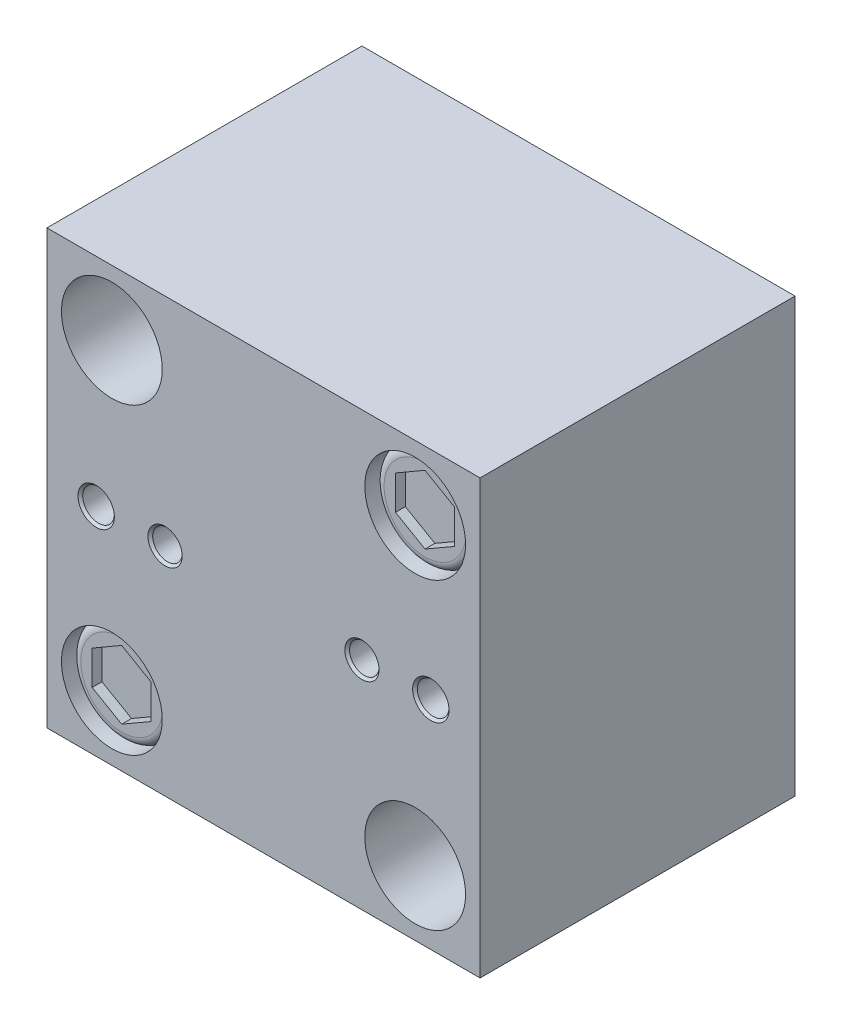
ISO-10303-21;
HEADER;
FILE_DESCRIPTION(('STEP AP214'),'2;1');
FILE_NAME('part.step','',(''),(''),'','','');
FILE_SCHEMA(('AUTOMOTIVE_DESIGN { 1 0 10303 214 1 1 1 1 }'));
ENDSEC;
DATA;
#1=APPLICATION_CONTEXT('core data for automotive mechanical design processes');
#2=APPLICATION_PROTOCOL_DEFINITION('international standard','automotive_design',2000,#1);
#3=PRODUCT_CONTEXT('',#1,'mechanical');
#4=PRODUCT('Part','Part','',(#3));
#5=PRODUCT_RELATED_PRODUCT_CATEGORY('part','',(#4));
#6=PRODUCT_DEFINITION_FORMATION('','',#4);
#7=PRODUCT_DEFINITION_CONTEXT('part definition',#1,'design');
#8=PRODUCT_DEFINITION('design','',#6,#7);
#9=PRODUCT_DEFINITION_SHAPE('','',#8);
#10=(LENGTH_UNIT() NAMED_UNIT(*) SI_UNIT(.MILLI.,.METRE.));
#11=(NAMED_UNIT(*) PLANE_ANGLE_UNIT() SI_UNIT($,.RADIAN.));
#12=(NAMED_UNIT(*) SI_UNIT($,.STERADIAN.) SOLID_ANGLE_UNIT());
#13=UNCERTAINTY_MEASURE_WITH_UNIT(LENGTH_MEASURE(1.E-05),#10,'distance_accuracy_value','');
#14=(GEOMETRIC_REPRESENTATION_CONTEXT(3) GLOBAL_UNCERTAINTY_ASSIGNED_CONTEXT((#13)) GLOBAL_UNIT_ASSIGNED_CONTEXT((#10,
#11,#12)) REPRESENTATION_CONTEXT('',''));
#15=CARTESIAN_POINT('',(0.,0.,0.));
#16=DIRECTION('',(0.,0.,1.));
#17=DIRECTION('',(1.,0.,0.));
#18=AXIS2_PLACEMENT_3D('',#15,#16,#17);
#19=CARTESIAN_POINT('',(-34.925,-34.925,49.2125));
#20=DIRECTION('',(0.,0.,1.));
#21=DIRECTION('',(1.,0.,0.));
#22=AXIS2_PLACEMENT_3D('',#19,#20,#21);
#23=PLANE('',#22);
#24=DIRECTION('',(-0.866025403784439,0.5,0.));
#25=VECTOR('',#24,1.);
#26=CARTESIAN_POINT('',(-19.6977,-21.7105693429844,49.2125));
#27=LINE('',#26,#25);
#28=CARTESIAN_POINT('',(-19.6977,-21.7105693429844,49.2125));
#29=VERTEX_POINT('',#28);
#30=CARTESIAN_POINT('',(-24.4602,-18.9609386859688,49.2125));
#31=VERTEX_POINT('',#30);
#32=EDGE_CURVE('E63',#29,#31,#27,.T.);
#33=ORIENTED_EDGE('',*,*,#32,.F.);
#34=DIRECTION('',(0.,1.,0.));
#35=VECTOR('',#34,1.);
#36=CARTESIAN_POINT('',(-19.6977,-27.2098306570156,49.2125));
#37=LINE('',#36,#35);
#38=CARTESIAN_POINT('',(-19.6977,-27.2098306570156,49.2125));
#39=VERTEX_POINT('',#38);
#40=EDGE_CURVE('E146',#39,#29,#37,.T.);
#41=ORIENTED_EDGE('',*,*,#40,.F.);
#42=DIRECTION('',(0.866025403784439,0.5,0.));
#43=VECTOR('',#42,1.);
#44=CARTESIAN_POINT('',(-24.4602,-29.9594613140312,49.2125));
#45=LINE('',#44,#43);
#46=CARTESIAN_POINT('',(-24.4602,-29.9594613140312,49.2125));
#47=VERTEX_POINT('',#46);
#48=EDGE_CURVE('E144',#47,#39,#45,.T.);
#49=ORIENTED_EDGE('',*,*,#48,.F.);
#50=DIRECTION('',(0.866025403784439,-0.499999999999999,0.));
#51=VECTOR('',#50,1.);
#52=CARTESIAN_POINT('',(-29.2227,-27.2098306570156,49.2125));
#53=LINE('',#52,#51);
#54=CARTESIAN_POINT('',(-29.2227,-27.2098306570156,49.2125));
#55=VERTEX_POINT('',#54);
#56=EDGE_CURVE('E111',#55,#47,#53,.T.);
#57=ORIENTED_EDGE('',*,*,#56,.F.);
#58=DIRECTION('',(0.,-1.,0.));
#59=VECTOR('',#58,1.);
#60=CARTESIAN_POINT('',(-29.2227,-21.7105693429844,49.2125));
#61=LINE('',#60,#59);
#62=CARTESIAN_POINT('',(-29.2227,-21.7105693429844,49.2125));
#63=VERTEX_POINT('',#62);
#64=EDGE_CURVE('E140',#63,#55,#61,.T.);
#65=ORIENTED_EDGE('',*,*,#64,.F.);
#66=DIRECTION('',(-0.866025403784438,-0.5,0.));
#67=VECTOR('',#66,1.);
#68=CARTESIAN_POINT('',(-24.4602,-18.9609386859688,49.2125));
#69=LINE('',#68,#67);
#70=EDGE_CURVE('E137',#31,#63,#69,.T.);
#71=ORIENTED_EDGE('',*,*,#70,.F.);
#72=EDGE_LOOP('',(#33,#41,#49,#57,#65,#71));
#73=FACE_BOUND('',#72,.T.);
#74=CARTESIAN_POINT('',(-24.4602,-24.4602,49.2125));
#75=DIRECTION('',(0.,0.,1.));
#76=DIRECTION('',(1.,0.,0.));
#77=AXIS2_PLACEMENT_3D('',#74,#75,#76);
#78=CIRCLE('',#77,6.60399999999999);
#79=CARTESIAN_POINT('',(-17.8562,-24.4602,49.2125));
#80=VERTEX_POINT('',#79);
#81=EDGE_CURVE('E12',#80,#80,#78,.T.);
#82=ORIENTED_EDGE('',*,*,#81,.T.);
#83=EDGE_LOOP('',(#82));
#84=FACE_BOUND('',#83,.T.);
#85=ADVANCED_FACE('F48',(#73,#84),#23,.T.);
#86=CARTESIAN_POINT('',(-24.4602,-24.4602,0.));
#87=DIRECTION('',(0.,0.,-1.));
#88=DIRECTION('',(-1.,0.,0.));
#89=AXIS2_PLACEMENT_3D('',#86,#87,#88);
#90=PLANE('',#89);
#91=CARTESIAN_POINT('',(-24.4602,-24.4602,0.));
#92=DIRECTION('',(0.,0.,-1.));
#93=DIRECTION('',(-1.,0.,0.));
#94=AXIS2_PLACEMENT_3D('',#91,#92,#93);
#95=CIRCLE('',#94,8.12799999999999);
#96=CARTESIAN_POINT('',(-32.5882,-24.4602,0.));
#97=VERTEX_POINT('',#96);
#98=EDGE_CURVE('E150',#97,#97,#95,.T.);
#99=ORIENTED_EDGE('',*,*,#98,.T.);
#100=EDGE_LOOP('',(#99));
#101=FACE_BOUND('',#100,.T.);
#102=ADVANCED_FACE('F172',(#101),#90,.T.);
#103=CARTESIAN_POINT('',(-24.4602,-24.4602,73.789455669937));
#104=DIRECTION('',(0.,0.,-1.));
#105=DIRECTION('',(-1.,0.,0.));
#106=AXIS2_PLACEMENT_3D('',#103,#104,#105);
#107=CYLINDRICAL_SURFACE('',#106,8.12799999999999);
#108=CARTESIAN_POINT('',(-24.4602,-24.4602,47.6885));
#109=DIRECTION('',(0.,0.,1.));
#110=DIRECTION('',(1.,0.,0.));
#111=AXIS2_PLACEMENT_3D('',#108,#109,#110);
#112=CIRCLE('',#111,8.12799999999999);
#113=CARTESIAN_POINT('',(-16.3322,-24.4602,47.6885));
#114=VERTEX_POINT('',#113);
#115=EDGE_CURVE('E56',#114,#114,#112,.F.);
#116=ORIENTED_EDGE('',*,*,#115,.T.);
#117=EDGE_LOOP('',(#116));
#118=FACE_BOUND('',#117,.T.);
#119=ORIENTED_EDGE('',*,*,#98,.F.);
#120=EDGE_LOOP('',(#119));
#121=FACE_BOUND('',#120,.T.);
#122=ADVANCED_FACE('F160',(#118,#121),#107,.T.);
#123=CARTESIAN_POINT('',(-24.4602,-24.4602,47.6885));
#124=DIRECTION('',(0.,0.,1.));
#125=DIRECTION('',(1.,0.,0.));
#126=AXIS2_PLACEMENT_3D('',#123,#124,#125);
#127=TOROIDAL_SURFACE('',#126,6.60399999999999,1.524);
#128=ORIENTED_EDGE('',*,*,#81,.F.);
#129=EDGE_LOOP('',(#128));
#130=FACE_BOUND('',#129,.T.);
#131=ORIENTED_EDGE('',*,*,#115,.F.);
#132=EDGE_LOOP('',(#131));
#133=FACE_BOUND('',#132,.T.);
#134=ADVANCED_FACE('F50',(#130,#133),#127,.T.);
#135=CARTESIAN_POINT('',(-19.6977,-21.7105693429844,47.625));
#136=DIRECTION('',(0.5,0.866025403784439,0.));
#137=DIRECTION('',(-0.866025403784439,0.5,0.));
#138=AXIS2_PLACEMENT_3D('',#135,#136,#137);
#139=PLANE('',#138);
#140=ORIENTED_EDGE('',*,*,#32,.T.);
#141=DIRECTION('',(0.,0.,1.));
#142=VECTOR('',#141,1.);
#143=CARTESIAN_POINT('',(-24.4602,-18.9609386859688,47.625));
#144=LINE('',#143,#142);
#145=CARTESIAN_POINT('',(-24.4602,-18.9609386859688,47.625));
#146=VERTEX_POINT('',#145);
#147=EDGE_CURVE('E93',#146,#31,#144,.T.);
#148=ORIENTED_EDGE('',*,*,#147,.F.);
#149=DIRECTION('',(-0.866025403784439,0.5,0.));
#150=VECTOR('',#149,1.);
#151=CARTESIAN_POINT('',(-19.6977,-21.7105693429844,47.625));
#152=LINE('',#151,#150);
#153=CARTESIAN_POINT('',(-19.6977,-21.7105693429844,47.625));
#154=VERTEX_POINT('',#153);
#155=EDGE_CURVE('E148',#154,#146,#152,.T.);
#156=ORIENTED_EDGE('',*,*,#155,.F.);
#157=DIRECTION('',(0.,0.,1.));
#158=VECTOR('',#157,1.);
#159=CARTESIAN_POINT('',(-19.6977,-21.7105693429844,47.625));
#160=LINE('',#159,#158);
#161=EDGE_CURVE('E71',#154,#29,#160,.T.);
#162=ORIENTED_EDGE('',*,*,#161,.T.);
#163=EDGE_LOOP('',(#140,#148,#156,#162));
#164=FACE_BOUND('',#163,.T.);
#165=ADVANCED_FACE('F164',(#164),#139,.F.);
#166=CARTESIAN_POINT('',(-19.6977,-27.2098306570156,47.625));
#167=DIRECTION('',(1.,0.,0.));
#168=DIRECTION('',(0.,0.,-1.));
#169=AXIS2_PLACEMENT_3D('',#166,#167,#168);
#170=PLANE('',#169);
#171=ORIENTED_EDGE('',*,*,#40,.T.);
#172=ORIENTED_EDGE('',*,*,#161,.F.);
#173=DIRECTION('',(0.,1.,0.));
#174=VECTOR('',#173,1.);
#175=CARTESIAN_POINT('',(-19.6977,-27.2098306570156,47.625));
#176=LINE('',#175,#174);
#177=CARTESIAN_POINT('',(-19.6977,-27.2098306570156,47.625));
#178=VERTEX_POINT('',#177);
#179=EDGE_CURVE('E123',#178,#154,#176,.T.);
#180=ORIENTED_EDGE('',*,*,#179,.F.);
#181=DIRECTION('',(0.,0.,1.));
#182=VECTOR('',#181,1.);
#183=CARTESIAN_POINT('',(-19.6977,-27.2098306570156,47.625));
#184=LINE('',#183,#182);
#185=EDGE_CURVE('E115',#178,#39,#184,.T.);
#186=ORIENTED_EDGE('',*,*,#185,.T.);
#187=EDGE_LOOP('',(#171,#172,#180,#186));
#188=FACE_BOUND('',#187,.T.);
#189=ADVANCED_FACE('F170',(#188),#170,.F.);
#190=CARTESIAN_POINT('',(-24.4602,-29.9594613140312,47.625));
#191=DIRECTION('',(0.5,-0.866025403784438,0.));
#192=DIRECTION('',(0.866025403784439,0.5,0.));
#193=AXIS2_PLACEMENT_3D('',#190,#191,#192);
#194=PLANE('',#193);
#195=ORIENTED_EDGE('',*,*,#48,.T.);
#196=ORIENTED_EDGE('',*,*,#185,.F.);
#197=DIRECTION('',(0.866025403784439,0.5,0.));
#198=VECTOR('',#197,1.);
#199=CARTESIAN_POINT('',(-24.4602,-29.9594613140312,47.625));
#200=LINE('',#199,#198);
#201=CARTESIAN_POINT('',(-24.4602,-29.9594613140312,47.625));
#202=VERTEX_POINT('',#201);
#203=EDGE_CURVE('E119',#202,#178,#200,.T.);
#204=ORIENTED_EDGE('',*,*,#203,.F.);
#205=DIRECTION('',(0.,0.,1.));
#206=VECTOR('',#205,1.);
#207=CARTESIAN_POINT('',(-24.4602,-29.9594613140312,47.625));
#208=LINE('',#207,#206);
#209=EDGE_CURVE('E104',#202,#47,#208,.T.);
#210=ORIENTED_EDGE('',*,*,#209,.T.);
#211=EDGE_LOOP('',(#195,#196,#204,#210));
#212=FACE_BOUND('',#211,.T.);
#213=ADVANCED_FACE('F120',(#212),#194,.F.);
#214=CARTESIAN_POINT('',(-29.2227,-27.2098306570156,47.625));
#215=DIRECTION('',(-0.499999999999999,-0.866025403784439,0.));
#216=DIRECTION('',(0.866025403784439,-0.5,0.));
#217=AXIS2_PLACEMENT_3D('',#214,#215,#216);
#218=PLANE('',#217);
#219=ORIENTED_EDGE('',*,*,#56,.T.);
#220=ORIENTED_EDGE('',*,*,#209,.F.);
#221=DIRECTION('',(0.866025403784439,-0.499999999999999,0.));
#222=VECTOR('',#221,1.);
#223=CARTESIAN_POINT('',(-29.2227,-27.2098306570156,47.625));
#224=LINE('',#223,#222);
#225=CARTESIAN_POINT('',(-29.2227,-27.2098306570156,47.625));
#226=VERTEX_POINT('',#225);
#227=EDGE_CURVE('E108',#226,#202,#224,.T.);
#228=ORIENTED_EDGE('',*,*,#227,.F.);
#229=DIRECTION('',(0.,0.,1.));
#230=VECTOR('',#229,1.);
#231=CARTESIAN_POINT('',(-29.2227,-27.2098306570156,47.625));
#232=LINE('',#231,#230);
#233=EDGE_CURVE('E116',#226,#55,#232,.T.);
#234=ORIENTED_EDGE('',*,*,#233,.T.);
#235=EDGE_LOOP('',(#219,#220,#228,#234));
#236=FACE_BOUND('',#235,.T.);
#237=ADVANCED_FACE('F106',(#236),#218,.F.);
#238=CARTESIAN_POINT('',(-29.2227,-21.7105693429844,47.625));
#239=DIRECTION('',(-1.,0.,0.));
#240=DIRECTION('',(0.,0.,1.));
#241=AXIS2_PLACEMENT_3D('',#238,#239,#240);
#242=PLANE('',#241);
#243=ORIENTED_EDGE('',*,*,#64,.T.);
#244=ORIENTED_EDGE('',*,*,#233,.F.);
#245=DIRECTION('',(0.,-1.,0.));
#246=VECTOR('',#245,1.);
#247=CARTESIAN_POINT('',(-29.2227,-21.7105693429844,47.625));
#248=LINE('',#247,#246);
#249=CARTESIAN_POINT('',(-29.2227,-21.7105693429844,47.625));
#250=VERTEX_POINT('',#249);
#251=EDGE_CURVE('E129',#250,#226,#248,.T.);
#252=ORIENTED_EDGE('',*,*,#251,.F.);
#253=DIRECTION('',(0.,0.,1.));
#254=VECTOR('',#253,1.);
#255=CARTESIAN_POINT('',(-29.2227,-21.7105693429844,47.625));
#256=LINE('',#255,#254);
#257=EDGE_CURVE('E153',#250,#63,#256,.T.);
#258=ORIENTED_EDGE('',*,*,#257,.T.);
#259=EDGE_LOOP('',(#243,#244,#252,#258));
#260=FACE_BOUND('',#259,.T.);
#261=ADVANCED_FACE('F187',(#260),#242,.F.);
#262=CARTESIAN_POINT('',(-24.4602,-18.9609386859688,47.625));
#263=DIRECTION('',(-0.5,0.866025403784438,0.));
#264=DIRECTION('',(-0.866025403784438,-0.5,0.));
#265=AXIS2_PLACEMENT_3D('',#262,#263,#264);
#266=PLANE('',#265);
#267=ORIENTED_EDGE('',*,*,#70,.T.);
#268=ORIENTED_EDGE('',*,*,#257,.F.);
#269=DIRECTION('',(-0.866025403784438,-0.5,0.));
#270=VECTOR('',#269,1.);
#271=CARTESIAN_POINT('',(-24.4602,-18.9609386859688,47.625));
#272=LINE('',#271,#270);
#273=EDGE_CURVE('E131',#146,#250,#272,.T.);
#274=ORIENTED_EDGE('',*,*,#273,.F.);
#275=ORIENTED_EDGE('',*,*,#147,.T.);
#276=EDGE_LOOP('',(#267,#268,#274,#275));
#277=FACE_BOUND('',#276,.T.);
#278=ADVANCED_FACE('F184',(#277),#266,.F.);
#279=CARTESIAN_POINT('',(0.,0.,47.625));
#280=DIRECTION('',(0.,0.,1.));
#281=DIRECTION('',(1.,0.,0.));
#282=AXIS2_PLACEMENT_3D('',#279,#280,#281);
#283=PLANE('',#282);
#284=ORIENTED_EDGE('',*,*,#155,.T.);
#285=ORIENTED_EDGE('',*,*,#273,.T.);
#286=ORIENTED_EDGE('',*,*,#251,.T.);
#287=ORIENTED_EDGE('',*,*,#227,.T.);
#288=ORIENTED_EDGE('',*,*,#203,.T.);
#289=ORIENTED_EDGE('',*,*,#179,.T.);
#290=EDGE_LOOP('',(#284,#285,#286,#287,#288,#289));
#291=FACE_BOUND('',#290,.T.);
#292=ADVANCED_FACE('F126',(#291),#283,.T.);
#293=CLOSED_SHELL('',(#85,#102,#122,#134,#165,#189,#213,#237,#261,#278,#292));
#294=MANIFOLD_SOLID_BREP('B2',#293);
#295=CARTESIAN_POINT('',(-34.925,-34.925,49.2125));
#296=DIRECTION('',(0.,0.,1.));
#297=DIRECTION('',(1.,0.,0.));
#298=AXIS2_PLACEMENT_3D('',#295,#296,#297);
#299=PLANE('',#298);
#300=DIRECTION('',(-0.866025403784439,0.5,0.));
#301=VECTOR('',#300,1.);
#302=CARTESIAN_POINT('',(29.2227,27.2098306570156,49.2125));
#303=LINE('',#302,#301);
#304=CARTESIAN_POINT('',(29.2227,27.2098306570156,49.2125));
#305=VERTEX_POINT('',#304);
#306=CARTESIAN_POINT('',(24.4602,29.9594613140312,49.2125));
#307=VERTEX_POINT('',#306);
#308=EDGE_CURVE('E294',#305,#307,#303,.T.);
#309=ORIENTED_EDGE('',*,*,#308,.F.);
#310=DIRECTION('',(0.,1.,0.));
#311=VECTOR('',#310,1.);
#312=CARTESIAN_POINT('',(29.2227,21.7105693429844,49.2125));
#313=LINE('',#312,#311);
#314=CARTESIAN_POINT('',(29.2227,21.7105693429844,49.2125));
#315=VERTEX_POINT('',#314);
#316=EDGE_CURVE('E377',#315,#305,#313,.T.);
#317=ORIENTED_EDGE('',*,*,#316,.F.);
#318=DIRECTION('',(0.866025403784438,0.5,0.));
#319=VECTOR('',#318,1.);
#320=CARTESIAN_POINT('',(24.4602,18.9609386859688,49.2125));
#321=LINE('',#320,#319);
#322=CARTESIAN_POINT('',(24.4602,18.9609386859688,49.2125));
#323=VERTEX_POINT('',#322);
#324=EDGE_CURVE('E375',#323,#315,#321,.T.);
#325=ORIENTED_EDGE('',*,*,#324,.F.);
#326=DIRECTION('',(0.866025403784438,-0.5,0.));
#327=VECTOR('',#326,1.);
#328=CARTESIAN_POINT('',(19.6977,21.7105693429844,49.2125));
#329=LINE('',#328,#327);
#330=CARTESIAN_POINT('',(19.6977,21.7105693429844,49.2125));
#331=VERTEX_POINT('',#330);
#332=EDGE_CURVE('E342',#331,#323,#329,.T.);
#333=ORIENTED_EDGE('',*,*,#332,.F.);
#334=DIRECTION('',(0.,-1.,0.));
#335=VECTOR('',#334,1.);
#336=CARTESIAN_POINT('',(19.6977,27.2098306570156,49.2125));
#337=LINE('',#336,#335);
#338=CARTESIAN_POINT('',(19.6977,27.2098306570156,49.2125));
#339=VERTEX_POINT('',#338);
#340=EDGE_CURVE('E371',#339,#331,#337,.T.);
#341=ORIENTED_EDGE('',*,*,#340,.F.);
#342=DIRECTION('',(-0.866025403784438,-0.5,0.));
#343=VECTOR('',#342,1.);
#344=CARTESIAN_POINT('',(24.4602,29.9594613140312,49.2125));
#345=LINE('',#344,#343);
#346=EDGE_CURVE('E368',#307,#339,#345,.T.);
#347=ORIENTED_EDGE('',*,*,#346,.F.);
#348=EDGE_LOOP('',(#309,#317,#325,#333,#341,#347));
#349=FACE_BOUND('',#348,.T.);
#350=CARTESIAN_POINT('',(24.4602,24.4602,49.2125));
#351=DIRECTION('',(0.,0.,1.));
#352=DIRECTION('',(1.,0.,0.));
#353=AXIS2_PLACEMENT_3D('',#350,#351,#352);
#354=CIRCLE('',#353,6.60399999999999);
#355=CARTESIAN_POINT('',(31.0642,24.4602,49.2125));
#356=VERTEX_POINT('',#355);
#357=EDGE_CURVE('E46',#356,#356,#354,.T.);
#358=ORIENTED_EDGE('',*,*,#357,.T.);
#359=EDGE_LOOP('',(#358));
#360=FACE_BOUND('',#359,.T.);
#361=ADVANCED_FACE('F279',(#349,#360),#299,.T.);
#362=CARTESIAN_POINT('',(24.4602,24.4602,0.));
#363=DIRECTION('',(0.,0.,-1.));
#364=DIRECTION('',(-1.,0.,0.));
#365=AXIS2_PLACEMENT_3D('',#362,#363,#364);
#366=PLANE('',#365);
#367=CARTESIAN_POINT('',(24.4602,24.4602,0.));
#368=DIRECTION('',(0.,0.,-1.));
#369=DIRECTION('',(-1.,0.,0.));
#370=AXIS2_PLACEMENT_3D('',#367,#368,#369);
#371=CIRCLE('',#370,8.12799999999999);
#372=CARTESIAN_POINT('',(16.3322,24.4602,0.));
#373=VERTEX_POINT('',#372);
#374=EDGE_CURVE('E381',#373,#373,#371,.T.);
#375=ORIENTED_EDGE('',*,*,#374,.T.);
#376=EDGE_LOOP('',(#375));
#377=FACE_BOUND('',#376,.T.);
#378=ADVANCED_FACE('F403',(#377),#366,.T.);
#379=CARTESIAN_POINT('',(24.4602,24.4602,73.789455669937));
#380=DIRECTION('',(0.,0.,-1.));
#381=DIRECTION('',(-1.,0.,0.));
#382=AXIS2_PLACEMENT_3D('',#379,#380,#381);
#383=CYLINDRICAL_SURFACE('',#382,8.12799999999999);
#384=CARTESIAN_POINT('',(24.4602,24.4602,47.6885));
#385=DIRECTION('',(0.,0.,1.));
#386=DIRECTION('',(1.,0.,0.));
#387=AXIS2_PLACEMENT_3D('',#384,#385,#386);
#388=CIRCLE('',#387,8.12799999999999);
#389=CARTESIAN_POINT('',(32.5882,24.4602,47.6885));
#390=VERTEX_POINT('',#389);
#391=EDGE_CURVE('E287',#390,#390,#388,.F.);
#392=ORIENTED_EDGE('',*,*,#391,.T.);
#393=EDGE_LOOP('',(#392));
#394=FACE_BOUND('',#393,.T.);
#395=ORIENTED_EDGE('',*,*,#374,.F.);
#396=EDGE_LOOP('',(#395));
#397=FACE_BOUND('',#396,.T.);
#398=ADVANCED_FACE('F391',(#394,#397),#383,.T.);
#399=CARTESIAN_POINT('',(24.4602,24.4602,47.6885));
#400=DIRECTION('',(0.,0.,1.));
#401=DIRECTION('',(1.,0.,0.));
#402=AXIS2_PLACEMENT_3D('',#399,#400,#401);
#403=TOROIDAL_SURFACE('',#402,6.60399999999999,1.524);
#404=ORIENTED_EDGE('',*,*,#357,.F.);
#405=EDGE_LOOP('',(#404));
#406=FACE_BOUND('',#405,.T.);
#407=ORIENTED_EDGE('',*,*,#391,.F.);
#408=EDGE_LOOP('',(#407));
#409=FACE_BOUND('',#408,.T.);
#410=ADVANCED_FACE('F281',(#406,#409),#403,.T.);
#411=CARTESIAN_POINT('',(29.2227,27.2098306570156,47.625));
#412=DIRECTION('',(0.5,0.866025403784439,0.));
#413=DIRECTION('',(-0.866025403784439,0.5,0.));
#414=AXIS2_PLACEMENT_3D('',#411,#412,#413);
#415=PLANE('',#414);
#416=ORIENTED_EDGE('',*,*,#308,.T.);
#417=DIRECTION('',(0.,0.,1.));
#418=VECTOR('',#417,1.);
#419=CARTESIAN_POINT('',(24.4602,29.9594613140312,47.625));
#420=LINE('',#419,#418);
#421=CARTESIAN_POINT('',(24.4602,29.9594613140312,47.625));
#422=VERTEX_POINT('',#421);
#423=EDGE_CURVE('E324',#422,#307,#420,.T.);
#424=ORIENTED_EDGE('',*,*,#423,.F.);
#425=DIRECTION('',(-0.866025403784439,0.5,0.));
#426=VECTOR('',#425,1.);
#427=CARTESIAN_POINT('',(29.2227,27.2098306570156,47.625));
#428=LINE('',#427,#426);
#429=CARTESIAN_POINT('',(29.2227,27.2098306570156,47.625));
#430=VERTEX_POINT('',#429);
#431=EDGE_CURVE('E379',#430,#422,#428,.T.);
#432=ORIENTED_EDGE('',*,*,#431,.F.);
#433=DIRECTION('',(0.,0.,1.));
#434=VECTOR('',#433,1.);
#435=CARTESIAN_POINT('',(29.2227,27.2098306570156,47.625));
#436=LINE('',#435,#434);
#437=EDGE_CURVE('E302',#430,#305,#436,.T.);
#438=ORIENTED_EDGE('',*,*,#437,.T.);
#439=EDGE_LOOP('',(#416,#424,#432,#438));
#440=FACE_BOUND('',#439,.T.);
#441=ADVANCED_FACE('F395',(#440),#415,.F.);
#442=CARTESIAN_POINT('',(29.2227,21.7105693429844,47.625));
#443=DIRECTION('',(1.,0.,0.));
#444=DIRECTION('',(0.,0.,-1.));
#445=AXIS2_PLACEMENT_3D('',#442,#443,#444);
#446=PLANE('',#445);
#447=ORIENTED_EDGE('',*,*,#316,.T.);
#448=ORIENTED_EDGE('',*,*,#437,.F.);
#449=DIRECTION('',(0.,1.,0.));
#450=VECTOR('',#449,1.);
#451=CARTESIAN_POINT('',(29.2227,21.7105693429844,47.625));
#452=LINE('',#451,#450);
#453=CARTESIAN_POINT('',(29.2227,21.7105693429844,47.625));
#454=VERTEX_POINT('',#453);
#455=EDGE_CURVE('E354',#454,#430,#452,.T.);
#456=ORIENTED_EDGE('',*,*,#455,.F.);
#457=DIRECTION('',(0.,0.,1.));
#458=VECTOR('',#457,1.);
#459=CARTESIAN_POINT('',(29.2227,21.7105693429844,47.625));
#460=LINE('',#459,#458);
#461=EDGE_CURVE('E346',#454,#315,#460,.T.);
#462=ORIENTED_EDGE('',*,*,#461,.T.);
#463=EDGE_LOOP('',(#447,#448,#456,#462));
#464=FACE_BOUND('',#463,.T.);
#465=ADVANCED_FACE('F401',(#464),#446,.F.);
#466=CARTESIAN_POINT('',(24.4602,18.9609386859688,47.625));
#467=DIRECTION('',(0.5,-0.866025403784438,0.));
#468=DIRECTION('',(0.866025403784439,0.5,0.));
#469=AXIS2_PLACEMENT_3D('',#466,#467,#468);
#470=PLANE('',#469);
#471=ORIENTED_EDGE('',*,*,#324,.T.);
#472=ORIENTED_EDGE('',*,*,#461,.F.);
#473=DIRECTION('',(0.866025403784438,0.5,0.));
#474=VECTOR('',#473,1.);
#475=CARTESIAN_POINT('',(24.4602,18.9609386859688,47.625));
#476=LINE('',#475,#474);
#477=CARTESIAN_POINT('',(24.4602,18.9609386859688,47.625));
#478=VERTEX_POINT('',#477);
#479=EDGE_CURVE('E350',#478,#454,#476,.T.);
#480=ORIENTED_EDGE('',*,*,#479,.F.);
#481=DIRECTION('',(0.,0.,1.));
#482=VECTOR('',#481,1.);
#483=CARTESIAN_POINT('',(24.4602,18.9609386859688,47.625));
#484=LINE('',#483,#482);
#485=EDGE_CURVE('E335',#478,#323,#484,.T.);
#486=ORIENTED_EDGE('',*,*,#485,.T.);
#487=EDGE_LOOP('',(#471,#472,#480,#486));
#488=FACE_BOUND('',#487,.T.);
#489=ADVANCED_FACE('F351',(#488),#470,.F.);
#490=CARTESIAN_POINT('',(19.6977,21.7105693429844,47.625));
#491=DIRECTION('',(-0.5,-0.866025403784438,0.));
#492=DIRECTION('',(0.866025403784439,-0.5,0.));
#493=AXIS2_PLACEMENT_3D('',#490,#491,#492);
#494=PLANE('',#493);
#495=ORIENTED_EDGE('',*,*,#332,.T.);
#496=ORIENTED_EDGE('',*,*,#485,.F.);
#497=DIRECTION('',(0.866025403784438,-0.5,0.));
#498=VECTOR('',#497,1.);
#499=CARTESIAN_POINT('',(19.6977,21.7105693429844,47.625));
#500=LINE('',#499,#498);
#501=CARTESIAN_POINT('',(19.6977,21.7105693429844,47.625));
#502=VERTEX_POINT('',#501);
#503=EDGE_CURVE('E339',#502,#478,#500,.T.);
#504=ORIENTED_EDGE('',*,*,#503,.F.);
#505=DIRECTION('',(0.,0.,1.));
#506=VECTOR('',#505,1.);
#507=CARTESIAN_POINT('',(19.6977,21.7105693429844,47.625));
#508=LINE('',#507,#506);
#509=EDGE_CURVE('E347',#502,#331,#508,.T.);
#510=ORIENTED_EDGE('',*,*,#509,.T.);
#511=EDGE_LOOP('',(#495,#496,#504,#510));
#512=FACE_BOUND('',#511,.T.);
#513=ADVANCED_FACE('F337',(#512),#494,.F.);
#514=CARTESIAN_POINT('',(19.6977,27.2098306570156,47.625));
#515=DIRECTION('',(-1.,0.,0.));
#516=DIRECTION('',(0.,0.,1.));
#517=AXIS2_PLACEMENT_3D('',#514,#515,#516);
#518=PLANE('',#517);
#519=ORIENTED_EDGE('',*,*,#340,.T.);
#520=ORIENTED_EDGE('',*,*,#509,.F.);
#521=DIRECTION('',(0.,-1.,0.));
#522=VECTOR('',#521,1.);
#523=CARTESIAN_POINT('',(19.6977,27.2098306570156,47.625));
#524=LINE('',#523,#522);
#525=CARTESIAN_POINT('',(19.6977,27.2098306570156,47.625));
#526=VERTEX_POINT('',#525);
#527=EDGE_CURVE('E360',#526,#502,#524,.T.);
#528=ORIENTED_EDGE('',*,*,#527,.F.);
#529=DIRECTION('',(0.,0.,1.));
#530=VECTOR('',#529,1.);
#531=CARTESIAN_POINT('',(19.6977,27.2098306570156,47.625));
#532=LINE('',#531,#530);
#533=EDGE_CURVE('E384',#526,#339,#532,.T.);
#534=ORIENTED_EDGE('',*,*,#533,.T.);
#535=EDGE_LOOP('',(#519,#520,#528,#534));
#536=FACE_BOUND('',#535,.T.);
#537=ADVANCED_FACE('F418',(#536),#518,.F.);
#538=CARTESIAN_POINT('',(24.4602,29.9594613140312,47.625));
#539=DIRECTION('',(-0.5,0.866025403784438,0.));
#540=DIRECTION('',(-0.866025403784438,-0.500000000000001,0.));
#541=AXIS2_PLACEMENT_3D('',#538,#539,#540);
#542=PLANE('',#541);
#543=ORIENTED_EDGE('',*,*,#346,.T.);
#544=ORIENTED_EDGE('',*,*,#533,.F.);
#545=DIRECTION('',(-0.866025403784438,-0.5,0.));
#546=VECTOR('',#545,1.);
#547=CARTESIAN_POINT('',(24.4602,29.9594613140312,47.625));
#548=LINE('',#547,#546);
#549=EDGE_CURVE('E362',#422,#526,#548,.T.);
#550=ORIENTED_EDGE('',*,*,#549,.F.);
#551=ORIENTED_EDGE('',*,*,#423,.T.);
#552=EDGE_LOOP('',(#543,#544,#550,#551));
#553=FACE_BOUND('',#552,.T.);
#554=ADVANCED_FACE('F415',(#553),#542,.F.);
#555=CARTESIAN_POINT('',(0.,0.,47.625));
#556=DIRECTION('',(0.,0.,1.));
#557=DIRECTION('',(1.,0.,0.));
#558=AXIS2_PLACEMENT_3D('',#555,#556,#557);
#559=PLANE('',#558);
#560=ORIENTED_EDGE('',*,*,#431,.T.);
#561=ORIENTED_EDGE('',*,*,#549,.T.);
#562=ORIENTED_EDGE('',*,*,#527,.T.);
#563=ORIENTED_EDGE('',*,*,#503,.T.);
#564=ORIENTED_EDGE('',*,*,#479,.T.);
#565=ORIENTED_EDGE('',*,*,#455,.T.);
#566=EDGE_LOOP('',(#560,#561,#562,#563,#564,#565));
#567=FACE_BOUND('',#566,.T.);
#568=ADVANCED_FACE('F357',(#567),#559,.T.);
#569=CLOSED_SHELL('',(#361,#378,#398,#410,#441,#465,#489,#513,#537,#554,#568));
#570=MANIFOLD_SOLID_BREP('B6',#569);
#571=CARTESIAN_POINT('',(-34.925,34.925,50.8));
#572=DIRECTION('',(1.,0.,0.));
#573=DIRECTION('',(0.,1.,0.));
#574=AXIS2_PLACEMENT_3D('',#571,#572,#573);
#575=PLANE('',#574);
#576=DIRECTION('',(0.,-1.,0.));
#577=VECTOR('',#576,1.);
#578=CARTESIAN_POINT('',(-34.925,34.925,0.));
#579=LINE('',#578,#577);
#580=CARTESIAN_POINT('',(-34.925,34.925,0.));
#581=VERTEX_POINT('',#580);
#582=CARTESIAN_POINT('',(-34.925,-34.925,0.));
#583=VERTEX_POINT('',#582);
#584=EDGE_CURVE('E612',#581,#583,#579,.T.);
#585=ORIENTED_EDGE('',*,*,#584,.T.);
#586=DIRECTION('',(0.,0.,-1.));
#587=VECTOR('',#586,1.);
#588=CARTESIAN_POINT('',(-34.925,-34.925,50.8));
#589=LINE('',#588,#587);
#590=CARTESIAN_POINT('',(-34.925,-34.925,50.8));
#591=VERTEX_POINT('',#590);
#592=EDGE_CURVE('E633',#591,#583,#589,.T.);
#593=ORIENTED_EDGE('',*,*,#592,.F.);
#594=DIRECTION('',(0.,-1.,0.));
#595=VECTOR('',#594,1.);
#596=CARTESIAN_POINT('',(-34.925,34.925,50.8));
#597=LINE('',#596,#595);
#598=CARTESIAN_POINT('',(-34.925,34.925,50.8));
#599=VERTEX_POINT('',#598);
#600=EDGE_CURVE('E615',#599,#591,#597,.T.);
#601=ORIENTED_EDGE('',*,*,#600,.F.);
#602=DIRECTION('',(0.,0.,-1.));
#603=VECTOR('',#602,1.);
#604=CARTESIAN_POINT('',(-34.925,34.925,50.8));
#605=LINE('',#604,#603);
#606=EDGE_CURVE('E621',#599,#581,#605,.T.);
#607=ORIENTED_EDGE('',*,*,#606,.T.);
#608=EDGE_LOOP('',(#585,#593,#601,#607));
#609=FACE_BOUND('',#608,.T.);
#610=ADVANCED_FACE('F501',(#609),#575,.F.);
#611=CARTESIAN_POINT('',(-34.925,-34.925,50.8));
#612=DIRECTION('',(0.,1.,0.));
#613=DIRECTION('',(0.,0.,1.));
#614=AXIS2_PLACEMENT_3D('',#611,#612,#613);
#615=PLANE('',#614);
#616=DIRECTION('',(1.,0.,0.));
#617=VECTOR('',#616,1.);
#618=CARTESIAN_POINT('',(-34.925,-34.925,0.));
#619=LINE('',#618,#617);
#620=CARTESIAN_POINT('',(34.925,-34.925,0.));
#621=VERTEX_POINT('',#620);
#622=EDGE_CURVE('E624',#583,#621,#619,.T.);
#623=ORIENTED_EDGE('',*,*,#622,.T.);
#624=DIRECTION('',(0.,0.,-1.));
#625=VECTOR('',#624,1.);
#626=CARTESIAN_POINT('',(34.925,-34.925,50.8));
#627=LINE('',#626,#625);
#628=CARTESIAN_POINT('',(34.925,-34.925,50.8));
#629=VERTEX_POINT('',#628);
#630=EDGE_CURVE('E631',#629,#621,#627,.T.);
#631=ORIENTED_EDGE('',*,*,#630,.F.);
#632=DIRECTION('',(1.,0.,0.));
#633=VECTOR('',#632,1.);
#634=CARTESIAN_POINT('',(-34.925,-34.925,50.8));
#635=LINE('',#634,#633);
#636=EDGE_CURVE('E550',#591,#629,#635,.T.);
#637=ORIENTED_EDGE('',*,*,#636,.F.);
#638=ORIENTED_EDGE('',*,*,#592,.T.);
#639=EDGE_LOOP('',(#623,#631,#637,#638));
#640=FACE_BOUND('',#639,.T.);
#641=ADVANCED_FACE('F670',(#640),#615,.F.);
#642=CARTESIAN_POINT('',(34.925,34.925,50.8));
#643=DIRECTION('',(-1.,0.,0.));
#644=DIRECTION('',(0.,-1.,0.));
#645=AXIS2_PLACEMENT_3D('',#642,#643,#644);
#646=PLANE('',#645);
#647=DIRECTION('',(0.,1.,0.));
#648=VECTOR('',#647,1.);
#649=CARTESIAN_POINT('',(34.925,34.925,0.));
#650=LINE('',#649,#648);
#651=CARTESIAN_POINT('',(34.925,34.925,0.));
#652=VERTEX_POINT('',#651);
#653=EDGE_CURVE('E536',#621,#652,#650,.T.);
#654=ORIENTED_EDGE('',*,*,#653,.T.);
#655=DIRECTION('',(0.,0.,-1.));
#656=VECTOR('',#655,1.);
#657=CARTESIAN_POINT('',(34.925,34.925,50.8));
#658=LINE('',#657,#656);
#659=CARTESIAN_POINT('',(34.925,34.925,50.8));
#660=VERTEX_POINT('',#659);
#661=EDGE_CURVE('E629',#660,#652,#658,.T.);
#662=ORIENTED_EDGE('',*,*,#661,.F.);
#663=DIRECTION('',(0.,1.,0.));
#664=VECTOR('',#663,1.);
#665=CARTESIAN_POINT('',(34.925,34.925,50.8));
#666=LINE('',#665,#664);
#667=EDGE_CURVE('E618',#629,#660,#666,.T.);
#668=ORIENTED_EDGE('',*,*,#667,.F.);
#669=ORIENTED_EDGE('',*,*,#630,.T.);
#670=EDGE_LOOP('',(#654,#662,#668,#669));
#671=FACE_BOUND('',#670,.T.);
#672=ADVANCED_FACE('F676',(#671),#646,.F.);
#673=CARTESIAN_POINT('',(-34.925,34.925,50.8));
#674=DIRECTION('',(0.,-1.,0.));
#675=DIRECTION('',(0.,0.,-1.));
#676=AXIS2_PLACEMENT_3D('',#673,#674,#675);
#677=PLANE('',#676);
#678=DIRECTION('',(-1.,0.,0.));
#679=VECTOR('',#678,1.);
#680=CARTESIAN_POINT('',(-34.925,34.925,0.));
#681=LINE('',#680,#679);
#682=EDGE_CURVE('E542',#652,#581,#681,.T.);
#683=ORIENTED_EDGE('',*,*,#682,.T.);
#684=ORIENTED_EDGE('',*,*,#606,.F.);
#685=DIRECTION('',(-1.,0.,0.));
#686=VECTOR('',#685,1.);
#687=CARTESIAN_POINT('',(-34.925,34.925,50.8));
#688=LINE('',#687,#686);
#689=EDGE_CURVE('E518',#660,#599,#688,.T.);
#690=ORIENTED_EDGE('',*,*,#689,.F.);
#691=ORIENTED_EDGE('',*,*,#661,.T.);
#692=EDGE_LOOP('',(#683,#684,#690,#691));
#693=FACE_BOUND('',#692,.T.);
#694=ADVANCED_FACE('F746',(#693),#677,.F.);
#695=CARTESIAN_POINT('',(-34.925,-34.925,50.8));
#696=DIRECTION('',(0.,0.,1.));
#697=DIRECTION('',(1.,0.,0.));
#698=AXIS2_PLACEMENT_3D('',#695,#696,#697);
#699=PLANE('',#698);
#700=CARTESIAN_POINT('',(26.9875,0.,50.8));
#701=DIRECTION('',(0.,0.,1.));
#702=DIRECTION('',(1.,0.,0.));
#703=AXIS2_PLACEMENT_3D('',#700,#701,#702);
#704=CIRCLE('',#703,2.93370000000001);
#705=CARTESIAN_POINT('',(29.9212,0.,50.8));
#706=VERTEX_POINT('',#705);
#707=EDGE_CURVE('E647',#706,#706,#704,.F.);
#708=ORIENTED_EDGE('',*,*,#707,.T.);
#709=EDGE_LOOP('',(#708));
#710=FACE_BOUND('',#709,.T.);
#711=CARTESIAN_POINT('',(-15.875,0.,50.8));
#712=DIRECTION('',(0.,0.,1.));
#713=DIRECTION('',(1.,0.,0.));
#714=AXIS2_PLACEMENT_3D('',#711,#712,#713);
#715=CIRCLE('',#714,2.76225000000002);
#716=CARTESIAN_POINT('',(-13.11275,0.,50.8));
#717=VERTEX_POINT('',#716);
#718=EDGE_CURVE('E644',#717,#717,#715,.F.);
#719=ORIENTED_EDGE('',*,*,#718,.T.);
#720=EDGE_LOOP('',(#719));
#721=FACE_BOUND('',#720,.T.);
#722=CARTESIAN_POINT('',(-26.9875,0.,50.8));
#723=DIRECTION('',(0.,0.,1.));
#724=DIRECTION('',(1.,0.,0.));
#725=AXIS2_PLACEMENT_3D('',#722,#723,#724);
#726=CIRCLE('',#725,2.93370000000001);
#727=CARTESIAN_POINT('',(-24.0538,0.,50.8));
#728=VERTEX_POINT('',#727);
#729=EDGE_CURVE('E641',#728,#728,#726,.F.);
#730=ORIENTED_EDGE('',*,*,#729,.T.);
#731=EDGE_LOOP('',(#730));
#732=FACE_BOUND('',#731,.T.);
#733=CARTESIAN_POINT('',(15.875,0.,50.8));
#734=DIRECTION('',(0.,0.,1.));
#735=DIRECTION('',(1.,0.,0.));
#736=AXIS2_PLACEMENT_3D('',#733,#734,#735);
#737=CIRCLE('',#736,2.76225000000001);
#738=CARTESIAN_POINT('',(18.63725,0.,50.8));
#739=VERTEX_POINT('',#738);
#740=EDGE_CURVE('E638',#739,#739,#737,.F.);
#741=ORIENTED_EDGE('',*,*,#740,.T.);
#742=EDGE_LOOP('',(#741));
#743=FACE_BOUND('',#742,.T.);
#744=CARTESIAN_POINT('',(24.4602,-24.4602,50.8));
#745=DIRECTION('',(0.,0.,1.));
#746=DIRECTION('',(1.,0.,0.));
#747=AXIS2_PLACEMENT_3D('',#744,#745,#746);
#748=CIRCLE('',#747,8.12799999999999);
#749=CARTESIAN_POINT('',(32.5882,-24.4602,50.8));
#750=VERTEX_POINT('',#749);
#751=EDGE_CURVE('E590',#750,#750,#748,.T.);
#752=ORIENTED_EDGE('',*,*,#751,.F.);
#753=EDGE_LOOP('',(#752));
#754=FACE_BOUND('',#753,.T.);
#755=CARTESIAN_POINT('',(-24.4602,-24.4602,50.8));
#756=DIRECTION('',(0.,0.,1.));
#757=DIRECTION('',(1.,0.,0.));
#758=AXIS2_PLACEMENT_3D('',#755,#756,#757);
#759=CIRCLE('',#758,8.12799999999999);
#760=CARTESIAN_POINT('',(-16.3322,-24.4602,50.8));
#761=VERTEX_POINT('',#760);
#762=EDGE_CURVE('E594',#761,#761,#759,.T.);
#763=ORIENTED_EDGE('',*,*,#762,.F.);
#764=EDGE_LOOP('',(#763));
#765=FACE_BOUND('',#764,.T.);
#766=CARTESIAN_POINT('',(24.4602,24.4602,50.8));
#767=DIRECTION('',(0.,0.,1.));
#768=DIRECTION('',(1.,0.,0.));
#769=AXIS2_PLACEMENT_3D('',#766,#767,#768);
#770=CIRCLE('',#769,8.12799999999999);
#771=CARTESIAN_POINT('',(32.5882,24.4602,50.8));
#772=VERTEX_POINT('',#771);
#773=EDGE_CURVE('E600',#772,#772,#770,.T.);
#774=ORIENTED_EDGE('',*,*,#773,.F.);
#775=EDGE_LOOP('',(#774));
#776=FACE_BOUND('',#775,.T.);
#777=CARTESIAN_POINT('',(-24.4602,24.4602,50.8));
#778=DIRECTION('',(0.,0.,1.));
#779=DIRECTION('',(1.,0.,0.));
#780=AXIS2_PLACEMENT_3D('',#777,#778,#779);
#781=CIRCLE('',#780,8.12799999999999);
#782=CARTESIAN_POINT('',(-16.3322,24.4602,50.8));
#783=VERTEX_POINT('',#782);
#784=EDGE_CURVE('E606',#783,#783,#781,.T.);
#785=ORIENTED_EDGE('',*,*,#784,.F.);
#786=EDGE_LOOP('',(#785));
#787=FACE_BOUND('',#786,.T.);
#788=ORIENTED_EDGE('',*,*,#600,.T.);
#789=ORIENTED_EDGE('',*,*,#636,.T.);
#790=ORIENTED_EDGE('',*,*,#667,.T.);
#791=ORIENTED_EDGE('',*,*,#689,.T.);
#792=EDGE_LOOP('',(#788,#789,#790,#791));
#793=FACE_BOUND('',#792,.T.);
#794=ADVANCED_FACE('F743',(#710,#721,#732,#743,#754,#765,#776,#787,#793),#699,.T.);
#795=CARTESIAN_POINT('',(-34.925,-34.925,0.));
#796=DIRECTION('',(0.,0.,1.));
#797=DIRECTION('',(1.,0.,0.));
#798=AXIS2_PLACEMENT_3D('',#795,#796,#797);
#799=PLANE('',#798);
#800=CARTESIAN_POINT('',(15.875,0.,0.));
#801=DIRECTION('',(0.,0.,-1.));
#802=DIRECTION('',(-1.,0.,0.));
#803=AXIS2_PLACEMENT_3D('',#800,#801,#802);
#804=CIRCLE('',#803,2.98450000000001);
#805=CARTESIAN_POINT('',(12.8905,0.,0.));
#806=VERTEX_POINT('',#805);
#807=EDGE_CURVE('E570',#806,#806,#804,.T.);
#808=ORIENTED_EDGE('',*,*,#807,.F.);
#809=EDGE_LOOP('',(#808));
#810=FACE_BOUND('',#809,.T.);
#811=CARTESIAN_POINT('',(-15.875,0.,0.));
#812=DIRECTION('',(0.,0.,-1.));
#813=DIRECTION('',(-1.,0.,0.));
#814=AXIS2_PLACEMENT_3D('',#811,#812,#813);
#815=CIRCLE('',#814,2.98450000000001);
#816=CARTESIAN_POINT('',(-18.8595,0.,0.));
#817=VERTEX_POINT('',#816);
#818=EDGE_CURVE('E581',#817,#817,#815,.T.);
#819=ORIENTED_EDGE('',*,*,#818,.F.);
#820=EDGE_LOOP('',(#819));
#821=FACE_BOUND('',#820,.T.);
#822=CARTESIAN_POINT('',(24.4602,-24.4602,0.));
#823=DIRECTION('',(0.,0.,1.));
#824=DIRECTION('',(1.,0.,0.));
#825=AXIS2_PLACEMENT_3D('',#822,#823,#824);
#826=CIRCLE('',#825,8.12799999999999);
#827=CARTESIAN_POINT('',(32.5882,-24.4602,0.));
#828=VERTEX_POINT('',#827);
#829=EDGE_CURVE('E591',#828,#828,#826,.T.);
#830=ORIENTED_EDGE('',*,*,#829,.T.);
#831=EDGE_LOOP('',(#830));
#832=FACE_BOUND('',#831,.T.);
#833=CARTESIAN_POINT('',(-24.4602,-24.4602,0.));
#834=DIRECTION('',(0.,0.,1.));
#835=DIRECTION('',(1.,0.,0.));
#836=AXIS2_PLACEMENT_3D('',#833,#834,#835);
#837=CIRCLE('',#836,8.12799999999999);
#838=CARTESIAN_POINT('',(-16.3322,-24.4602,0.));
#839=VERTEX_POINT('',#838);
#840=EDGE_CURVE('E597',#839,#839,#837,.T.);
#841=ORIENTED_EDGE('',*,*,#840,.T.);
#842=EDGE_LOOP('',(#841));
#843=FACE_BOUND('',#842,.T.);
#844=CARTESIAN_POINT('',(24.4602,24.4602,0.));
#845=DIRECTION('',(0.,0.,1.));
#846=DIRECTION('',(1.,0.,0.));
#847=AXIS2_PLACEMENT_3D('',#844,#845,#846);
#848=CIRCLE('',#847,8.12799999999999);
#849=CARTESIAN_POINT('',(32.5882,24.4602,0.));
#850=VERTEX_POINT('',#849);
#851=EDGE_CURVE('E603',#850,#850,#848,.T.);
#852=ORIENTED_EDGE('',*,*,#851,.T.);
#853=EDGE_LOOP('',(#852));
#854=FACE_BOUND('',#853,.T.);
#855=CARTESIAN_POINT('',(-24.4602,24.4602,0.));
#856=DIRECTION('',(0.,0.,1.));
#857=DIRECTION('',(1.,0.,0.));
#858=AXIS2_PLACEMENT_3D('',#855,#856,#857);
#859=CIRCLE('',#858,8.12799999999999);
#860=CARTESIAN_POINT('',(-16.3322,24.4602,0.));
#861=VERTEX_POINT('',#860);
#862=EDGE_CURVE('E609',#861,#861,#859,.T.);
#863=ORIENTED_EDGE('',*,*,#862,.T.);
#864=EDGE_LOOP('',(#863));
#865=FACE_BOUND('',#864,.T.);
#866=ORIENTED_EDGE('',*,*,#584,.F.);
#867=ORIENTED_EDGE('',*,*,#682,.F.);
#868=ORIENTED_EDGE('',*,*,#653,.F.);
#869=ORIENTED_EDGE('',*,*,#622,.F.);
#870=EDGE_LOOP('',(#866,#867,#868,#869));
#871=FACE_BOUND('',#870,.T.);
#872=ADVANCED_FACE('F741',(#810,#821,#832,#843,#854,#865,#871),#799,.F.);
#873=CARTESIAN_POINT('',(-24.4602,24.4602,0.));
#874=DIRECTION('',(0.,0.,1.));
#875=DIRECTION('',(1.,0.,0.));
#876=AXIS2_PLACEMENT_3D('',#873,#874,#875);
#877=CYLINDRICAL_SURFACE('',#876,8.12799999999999);
#878=ORIENTED_EDGE('',*,*,#862,.F.);
#879=EDGE_LOOP('',(#878));
#880=FACE_BOUND('',#879,.T.);
#881=ORIENTED_EDGE('',*,*,#784,.T.);
#882=EDGE_LOOP('',(#881));
#883=FACE_BOUND('',#882,.T.);
#884=ADVANCED_FACE('F737',(#880,#883),#877,.F.);
#885=CARTESIAN_POINT('',(24.4602,24.4602,0.));
#886=DIRECTION('',(0.,0.,1.));
#887=DIRECTION('',(1.,0.,0.));
#888=AXIS2_PLACEMENT_3D('',#885,#886,#887);
#889=CYLINDRICAL_SURFACE('',#888,8.12799999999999);
#890=ORIENTED_EDGE('',*,*,#851,.F.);
#891=EDGE_LOOP('',(#890));
#892=FACE_BOUND('',#891,.T.);
#893=ORIENTED_EDGE('',*,*,#773,.T.);
#894=EDGE_LOOP('',(#893));
#895=FACE_BOUND('',#894,.T.);
#896=ADVANCED_FACE('F733',(#892,#895),#889,.F.);
#897=CARTESIAN_POINT('',(-24.4602,-24.4602,0.));
#898=DIRECTION('',(0.,0.,1.));
#899=DIRECTION('',(1.,0.,0.));
#900=AXIS2_PLACEMENT_3D('',#897,#898,#899);
#901=CYLINDRICAL_SURFACE('',#900,8.12799999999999);
#902=ORIENTED_EDGE('',*,*,#840,.F.);
#903=EDGE_LOOP('',(#902));
#904=FACE_BOUND('',#903,.T.);
#905=ORIENTED_EDGE('',*,*,#762,.T.);
#906=EDGE_LOOP('',(#905));
#907=FACE_BOUND('',#906,.T.);
#908=ADVANCED_FACE('F729',(#904,#907),#901,.F.);
#909=CARTESIAN_POINT('',(24.4602,-24.4602,0.));
#910=DIRECTION('',(0.,0.,1.));
#911=DIRECTION('',(1.,0.,0.));
#912=AXIS2_PLACEMENT_3D('',#909,#910,#911);
#913=CYLINDRICAL_SURFACE('',#912,8.12799999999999);
#914=ORIENTED_EDGE('',*,*,#829,.F.);
#915=EDGE_LOOP('',(#914));
#916=FACE_BOUND('',#915,.T.);
#917=ORIENTED_EDGE('',*,*,#751,.T.);
#918=EDGE_LOOP('',(#917));
#919=FACE_BOUND('',#918,.T.);
#920=ADVANCED_FACE('F725',(#916,#919),#913,.F.);
#921=CARTESIAN_POINT('',(-15.875,0.,0.));
#922=DIRECTION('',(0.,0.,-1.));
#923=DIRECTION('',(-1.,0.,0.));
#924=AXIS2_PLACEMENT_3D('',#921,#922,#923);
#925=CYLINDRICAL_SURFACE('',#924,2.38125000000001);
#926=CARTESIAN_POINT('',(-15.875,0.,50.419));
#927=DIRECTION('',(0.,0.,1.));
#928=DIRECTION('',(1.,0.,0.));
#929=AXIS2_PLACEMENT_3D('',#926,#927,#928);
#930=CIRCLE('',#929,2.38125000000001);
#931=CARTESIAN_POINT('',(-13.49375,0.,50.419));
#932=VERTEX_POINT('',#931);
#933=EDGE_CURVE('E650',#932,#932,#930,.T.);
#934=ORIENTED_EDGE('',*,*,#933,.T.);
#935=EDGE_LOOP('',(#934));
#936=FACE_BOUND('',#935,.T.);
#937=CARTESIAN_POINT('',(-15.875,0.,38.1));
#938=DIRECTION('',(0.,0.,-1.));
#939=DIRECTION('',(-1.,0.,0.));
#940=AXIS2_PLACEMENT_3D('',#937,#938,#939);
#941=CIRCLE('',#940,2.38125000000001);
#942=CARTESIAN_POINT('',(-18.25625,0.,38.1));
#943=VERTEX_POINT('',#942);
#944=EDGE_CURVE('E587',#943,#943,#941,.T.);
#945=ORIENTED_EDGE('',*,*,#944,.T.);
#946=EDGE_LOOP('',(#945));
#947=FACE_BOUND('',#946,.T.);
#948=ADVANCED_FACE('F721',(#936,#947),#925,.F.);
#949=CARTESIAN_POINT('',(-13.49375,0.,38.1));
#950=DIRECTION('',(0.,0.,1.));
#951=DIRECTION('',(1.,0.,0.));
#952=AXIS2_PLACEMENT_3D('',#949,#950,#951);
#953=PLANE('',#952);
#954=ORIENTED_EDGE('',*,*,#944,.F.);
#955=EDGE_LOOP('',(#954));
#956=FACE_BOUND('',#955,.T.);
#957=CARTESIAN_POINT('',(-15.875,0.,38.1));
#958=DIRECTION('',(0.,0.,-1.));
#959=DIRECTION('',(-1.,0.,0.));
#960=AXIS2_PLACEMENT_3D('',#957,#958,#959);
#961=CIRCLE('',#960,2.98450000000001);
#962=CARTESIAN_POINT('',(-18.8595,0.,38.1));
#963=VERTEX_POINT('',#962);
#964=EDGE_CURVE('E584',#963,#963,#961,.T.);
#965=ORIENTED_EDGE('',*,*,#964,.T.);
#966=EDGE_LOOP('',(#965));
#967=FACE_BOUND('',#966,.T.);
#968=ADVANCED_FACE('F717',(#956,#967),#953,.F.);
#969=CARTESIAN_POINT('',(-15.875,0.,0.));
#970=DIRECTION('',(0.,0.,-1.));
#971=DIRECTION('',(-1.,0.,0.));
#972=AXIS2_PLACEMENT_3D('',#969,#970,#971);
#973=CYLINDRICAL_SURFACE('',#972,2.98450000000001);
#974=ORIENTED_EDGE('',*,*,#964,.F.);
#975=EDGE_LOOP('',(#974));
#976=FACE_BOUND('',#975,.T.);
#977=ORIENTED_EDGE('',*,*,#818,.T.);
#978=EDGE_LOOP('',(#977));
#979=FACE_BOUND('',#978,.T.);
#980=ADVANCED_FACE('F713',(#976,#979),#973,.F.);
#981=CARTESIAN_POINT('',(15.875,0.,0.));
#982=DIRECTION('',(0.,0.,-1.));
#983=DIRECTION('',(-1.,0.,0.));
#984=AXIS2_PLACEMENT_3D('',#981,#982,#983);
#985=CYLINDRICAL_SURFACE('',#984,2.38125000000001);
#986=CARTESIAN_POINT('',(15.875,0.,50.419));
#987=DIRECTION('',(0.,0.,1.));
#988=DIRECTION('',(1.,0.,0.));
#989=AXIS2_PLACEMENT_3D('',#986,#987,#988);
#990=CIRCLE('',#989,2.38125000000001);
#991=CARTESIAN_POINT('',(18.25625,0.,50.419));
#992=VERTEX_POINT('',#991);
#993=EDGE_CURVE('E277',#992,#992,#990,.T.);
#994=ORIENTED_EDGE('',*,*,#993,.T.);
#995=EDGE_LOOP('',(#994));
#996=FACE_BOUND('',#995,.T.);
#997=CARTESIAN_POINT('',(15.875,0.,38.1));
#998=DIRECTION('',(0.,0.,-1.));
#999=DIRECTION('',(-1.,0.,0.));
#1000=AXIS2_PLACEMENT_3D('',#997,#998,#999);
#1001=CIRCLE('',#1000,2.38125000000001);
#1002=CARTESIAN_POINT('',(13.49375,0.,38.1));
#1003=VERTEX_POINT('',#1002);
#1004=EDGE_CURVE('E578',#1003,#1003,#1001,.T.);
#1005=ORIENTED_EDGE('',*,*,#1004,.T.);
#1006=EDGE_LOOP('',(#1005));
#1007=FACE_BOUND('',#1006,.T.);
#1008=ADVANCED_FACE('F709',(#996,#1007),#985,.F.);
#1009=CARTESIAN_POINT('',(18.25625,0.,38.1));
#1010=DIRECTION('',(0.,0.,1.));
#1011=DIRECTION('',(1.,0.,0.));
#1012=AXIS2_PLACEMENT_3D('',#1009,#1010,#1011);
#1013=PLANE('',#1012);
#1014=ORIENTED_EDGE('',*,*,#1004,.F.);
#1015=EDGE_LOOP('',(#1014));
#1016=FACE_BOUND('',#1015,.T.);
#1017=CARTESIAN_POINT('',(15.875,0.,38.1));
#1018=DIRECTION('',(0.,0.,-1.));
#1019=DIRECTION('',(-1.,0.,0.));
#1020=AXIS2_PLACEMENT_3D('',#1017,#1018,#1019);
#1021=CIRCLE('',#1020,2.98450000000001);
#1022=CARTESIAN_POINT('',(12.8905,0.,38.1));
#1023=VERTEX_POINT('',#1022);
#1024=EDGE_CURVE('E575',#1023,#1023,#1021,.T.);
#1025=ORIENTED_EDGE('',*,*,#1024,.T.);
#1026=EDGE_LOOP('',(#1025));
#1027=FACE_BOUND('',#1026,.T.);
#1028=ADVANCED_FACE('F703',(#1016,#1027),#1013,.F.);
#1029=CARTESIAN_POINT('',(15.875,0.,0.));
#1030=DIRECTION('',(0.,0.,-1.));
#1031=DIRECTION('',(-1.,0.,0.));
#1032=AXIS2_PLACEMENT_3D('',#1029,#1030,#1031);
#1033=CYLINDRICAL_SURFACE('',#1032,2.98450000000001);
#1034=ORIENTED_EDGE('',*,*,#1024,.F.);
#1035=EDGE_LOOP('',(#1034));
#1036=FACE_BOUND('',#1035,.T.);
#1037=ORIENTED_EDGE('',*,*,#807,.T.);
#1038=EDGE_LOOP('',(#1037));
#1039=FACE_BOUND('',#1038,.T.);
#1040=ADVANCED_FACE('F697',(#1036,#1039),#1033,.F.);
#1041=CARTESIAN_POINT('',(26.9875,0.,25.4));
#1042=DIRECTION('',(0.,0.,1.));
#1043=DIRECTION('',(1.,0.,0.));
#1044=AXIS2_PLACEMENT_3D('',#1041,#1042,#1043);
#1045=CONICAL_SURFACE('',#1044,2.55269999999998,1.02974425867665);
#1046=CARTESIAN_POINT('',(26.9875,0.,23.8661830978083));
#1047=VERTEX_POINT('',#1046);
#1048=VERTEX_LOOP('',#1047);
#1049=FACE_BOUND('',#1048,.T.);
#1050=CARTESIAN_POINT('',(26.9875,0.,25.4));
#1051=DIRECTION('',(0.,0.,1.));
#1052=DIRECTION('',(1.,0.,0.));
#1053=AXIS2_PLACEMENT_3D('',#1050,#1051,#1052);
#1054=CIRCLE('',#1053,2.55269999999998);
#1055=CARTESIAN_POINT('',(29.5402,0.,25.4));
#1056=VERTEX_POINT('',#1055);
#1057=EDGE_CURVE('E567',#1056,#1056,#1054,.T.);
#1058=ORIENTED_EDGE('',*,*,#1057,.T.);
#1059=EDGE_LOOP('',(#1058));
#1060=FACE_BOUND('',#1059,.T.);
#1061=ADVANCED_FACE('F692',(#1049,#1060),#1045,.F.);
#1062=CARTESIAN_POINT('',(26.9875,0.,50.8));
#1063=DIRECTION('',(0.,0.,1.));
#1064=DIRECTION('',(1.,0.,0.));
#1065=AXIS2_PLACEMENT_3D('',#1062,#1063,#1064);
#1066=CYLINDRICAL_SURFACE('',#1065,2.55269999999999);
#1067=CARTESIAN_POINT('',(26.9875,0.,50.419));
#1068=DIRECTION('',(0.,0.,1.));
#1069=DIRECTION('',(1.,0.,0.));
#1070=AXIS2_PLACEMENT_3D('',#1067,#1068,#1069);
#1071=CIRCLE('',#1070,2.55269999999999);
#1072=CARTESIAN_POINT('',(29.5402,0.,50.419));
#1073=VERTEX_POINT('',#1072);
#1074=EDGE_CURVE('E635',#1073,#1073,#1071,.T.);
#1075=ORIENTED_EDGE('',*,*,#1074,.T.);
#1076=EDGE_LOOP('',(#1075));
#1077=FACE_BOUND('',#1076,.T.);
#1078=ORIENTED_EDGE('',*,*,#1057,.F.);
#1079=EDGE_LOOP('',(#1078));
#1080=FACE_BOUND('',#1079,.T.);
#1081=ADVANCED_FACE('F561',(#1077,#1080),#1066,.F.);
#1082=CARTESIAN_POINT('',(-26.9875,0.,25.4));
#1083=DIRECTION('',(0.,0.,1.));
#1084=DIRECTION('',(1.,0.,0.));
#1085=AXIS2_PLACEMENT_3D('',#1082,#1083,#1084);
#1086=CONICAL_SURFACE('',#1085,2.55269999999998,1.02974425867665);
#1087=CARTESIAN_POINT('',(-26.9875,0.,23.8661830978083));
#1088=VERTEX_POINT('',#1087);
#1089=VERTEX_LOOP('',#1088);
#1090=FACE_BOUND('',#1089,.T.);
#1091=CARTESIAN_POINT('',(-26.9875,0.,25.4));
#1092=DIRECTION('',(0.,0.,1.));
#1093=DIRECTION('',(1.,0.,0.));
#1094=AXIS2_PLACEMENT_3D('',#1091,#1092,#1093);
#1095=CIRCLE('',#1094,2.55269999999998);
#1096=CARTESIAN_POINT('',(-24.4348,0.,25.4));
#1097=VERTEX_POINT('',#1096);
#1098=EDGE_CURVE('E565',#1097,#1097,#1095,.T.);
#1099=ORIENTED_EDGE('',*,*,#1098,.T.);
#1100=EDGE_LOOP('',(#1099));
#1101=FACE_BOUND('',#1100,.T.);
#1102=ADVANCED_FACE('F557',(#1090,#1101),#1086,.F.);
#1103=CARTESIAN_POINT('',(-26.9875,0.,50.8));
#1104=DIRECTION('',(0.,0.,1.));
#1105=DIRECTION('',(1.,0.,0.));
#1106=AXIS2_PLACEMENT_3D('',#1103,#1104,#1105);
#1107=CYLINDRICAL_SURFACE('',#1106,2.55269999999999);
#1108=CARTESIAN_POINT('',(-26.9875,0.,50.419));
#1109=DIRECTION('',(0.,0.,1.));
#1110=DIRECTION('',(1.,0.,0.));
#1111=AXIS2_PLACEMENT_3D('',#1108,#1109,#1110);
#1112=CIRCLE('',#1111,2.55269999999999);
#1113=CARTESIAN_POINT('',(-24.4348,0.,50.419));
#1114=VERTEX_POINT('',#1113);
#1115=EDGE_CURVE('E510',#1114,#1114,#1112,.T.);
#1116=ORIENTED_EDGE('',*,*,#1115,.T.);
#1117=EDGE_LOOP('',(#1116));
#1118=FACE_BOUND('',#1117,.T.);
#1119=ORIENTED_EDGE('',*,*,#1098,.F.);
#1120=EDGE_LOOP('',(#1119));
#1121=FACE_BOUND('',#1120,.T.);
#1122=ADVANCED_FACE('F560',(#1118,#1121),#1107,.F.);
#1123=CARTESIAN_POINT('',(26.9875,0.,50.419));
#1124=DIRECTION('',(0.,0.,1.));
#1125=DIRECTION('',(1.,0.,0.));
#1126=AXIS2_PLACEMENT_3D('',#1123,#1124,#1125);
#1127=CONICAL_SURFACE('',#1126,2.55269999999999,0.785398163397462);
#1128=ORIENTED_EDGE('',*,*,#707,.F.);
#1129=EDGE_LOOP('',(#1128));
#1130=FACE_BOUND('',#1129,.T.);
#1131=ORIENTED_EDGE('',*,*,#1074,.F.);
#1132=EDGE_LOOP('',(#1131));
#1133=FACE_BOUND('',#1132,.T.);
#1134=ADVANCED_FACE('F665',(#1130,#1133),#1127,.F.);
#1135=CARTESIAN_POINT('',(-15.875,0.,50.8));
#1136=DIRECTION('',(0.,0.,1.));
#1137=DIRECTION('',(1.,0.,0.));
#1138=AXIS2_PLACEMENT_3D('',#1135,#1136,#1137);
#1139=CONICAL_SURFACE('',#1138,2.76225000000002,0.785398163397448);
#1140=ORIENTED_EDGE('',*,*,#933,.F.);
#1141=EDGE_LOOP('',(#1140));
#1142=FACE_BOUND('',#1141,.T.);
#1143=ORIENTED_EDGE('',*,*,#718,.F.);
#1144=EDGE_LOOP('',(#1143));
#1145=FACE_BOUND('',#1144,.T.);
#1146=ADVANCED_FACE('F658',(#1142,#1145),#1139,.F.);
#1147=CARTESIAN_POINT('',(-26.9875,0.,50.419));
#1148=DIRECTION('',(0.,0.,1.));
#1149=DIRECTION('',(1.,0.,0.));
#1150=AXIS2_PLACEMENT_3D('',#1147,#1148,#1149);
#1151=CONICAL_SURFACE('',#1150,2.55269999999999,0.785398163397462);
#1152=ORIENTED_EDGE('',*,*,#729,.F.);
#1153=EDGE_LOOP('',(#1152));
#1154=FACE_BOUND('',#1153,.T.);
#1155=ORIENTED_EDGE('',*,*,#1115,.F.);
#1156=EDGE_LOOP('',(#1155));
#1157=FACE_BOUND('',#1156,.T.);
#1158=ADVANCED_FACE('F656',(#1154,#1157),#1151,.F.);
#1159=CARTESIAN_POINT('',(15.875,0.,50.8));
#1160=DIRECTION('',(0.,0.,1.));
#1161=DIRECTION('',(1.,0.,0.));
#1162=AXIS2_PLACEMENT_3D('',#1159,#1160,#1161);
#1163=CONICAL_SURFACE('',#1162,2.76225000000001,0.785398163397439);
#1164=CARTESIAN_POINT('',(18.25625,0.,50.419));
#1165=CARTESIAN_POINT('',(18.26021875,0.,50.42296875));
#1166=CARTESIAN_POINT('',(18.2641875,0.,50.4269375));
#1167=CARTESIAN_POINT('',(18.272125,0.,50.434875));
#1168=CARTESIAN_POINT('',(18.27609375,0.,50.43884375));
#1169=CARTESIAN_POINT('',(18.28403125,0.,50.44678125));
#1170=CARTESIAN_POINT('',(18.288,0.,50.45075));
#1171=CARTESIAN_POINT('',(18.2959375,0.,50.4586875));
#1172=CARTESIAN_POINT('',(18.29990625,0.,50.46265625));
#1173=CARTESIAN_POINT('',(18.30784375,0.,50.47059375));
#1174=CARTESIAN_POINT('',(18.3118125,0.,50.4745625));
#1175=CARTESIAN_POINT('',(18.31975,0.,50.4825));
#1176=CARTESIAN_POINT('',(18.32371875,0.,50.48646875));
#1177=CARTESIAN_POINT('',(18.33165625,0.,50.49440625));
#1178=CARTESIAN_POINT('',(18.335625,0.,50.498375));
#1179=CARTESIAN_POINT('',(18.3435625,0.,50.5063125));
#1180=CARTESIAN_POINT('',(18.34753125,0.,50.51028125));
#1181=CARTESIAN_POINT('',(18.35546875,0.,50.51821875));
#1182=CARTESIAN_POINT('',(18.3594375,0.,50.5221875));
#1183=CARTESIAN_POINT('',(18.367375,0.,50.530125));
#1184=CARTESIAN_POINT('',(18.37134375,0.,50.53409375));
#1185=CARTESIAN_POINT('',(18.37928125,0.,50.54203125));
#1186=CARTESIAN_POINT('',(18.38325,0.,50.546));
#1187=CARTESIAN_POINT('',(18.3911875,0.,50.5539375));
#1188=CARTESIAN_POINT('',(18.39515625,0.,50.55790625));
#1189=CARTESIAN_POINT('',(18.40309375,0.,50.56584375));
#1190=CARTESIAN_POINT('',(18.4070625,0.,50.5698125));
#1191=CARTESIAN_POINT('',(18.415,0.,50.57775));
#1192=CARTESIAN_POINT('',(18.41896875,0.,50.58171875));
#1193=CARTESIAN_POINT('',(18.42690625,0.,50.58965625));
#1194=CARTESIAN_POINT('',(18.430875,0.,50.593625));
#1195=CARTESIAN_POINT('',(18.4388125,0.,50.6015625));
#1196=CARTESIAN_POINT('',(18.44278125,0.,50.60553125));
#1197=CARTESIAN_POINT('',(18.45071875,0.,50.61346875));
#1198=CARTESIAN_POINT('',(18.4546875,0.,50.6174375));
#1199=CARTESIAN_POINT('',(18.462625,0.,50.625375));
#1200=CARTESIAN_POINT('',(18.46659375,0.,50.62934375));
#1201=CARTESIAN_POINT('',(18.47453125,0.,50.63728125));
#1202=CARTESIAN_POINT('',(18.4785,0.,50.64125));
#1203=CARTESIAN_POINT('',(18.4864375,0.,50.6491875));
#1204=CARTESIAN_POINT('',(18.49040625,0.,50.65315625));
#1205=CARTESIAN_POINT('',(18.49834375,0.,50.66109375));
#1206=CARTESIAN_POINT('',(18.5023125,0.,50.6650625));
#1207=CARTESIAN_POINT('',(18.51025,0.,50.673));
#1208=CARTESIAN_POINT('',(18.51421875,0.,50.67696875));
#1209=CARTESIAN_POINT('',(18.52215625,0.,50.68490625));
#1210=CARTESIAN_POINT('',(18.526125,0.,50.688875));
#1211=CARTESIAN_POINT('',(18.5340625,0.,50.6968125));
#1212=CARTESIAN_POINT('',(18.53803125,0.,50.70078125));
#1213=CARTESIAN_POINT('',(18.54596875,0.,50.70871875));
#1214=CARTESIAN_POINT('',(18.5499375,0.,50.7126875));
#1215=CARTESIAN_POINT('',(18.557875,0.,50.720625));
#1216=CARTESIAN_POINT('',(18.56184375,0.,50.72459375));
#1217=CARTESIAN_POINT('',(18.56978125,0.,50.73253125));
#1218=CARTESIAN_POINT('',(18.57375,0.,50.7365));
#1219=CARTESIAN_POINT('',(18.5816875,0.,50.7444375));
#1220=CARTESIAN_POINT('',(18.58565625,0.,50.74840625));
#1221=CARTESIAN_POINT('',(18.59359375,0.,50.75634375));
#1222=CARTESIAN_POINT('',(18.5975625,0.,50.7603125));
#1223=CARTESIAN_POINT('',(18.6055,0.,50.76825));
#1224=CARTESIAN_POINT('',(18.60946875,0.,50.77221875));
#1225=CARTESIAN_POINT('',(18.61740625,0.,50.78015625));
#1226=CARTESIAN_POINT('',(18.621375,0.,50.784125));
#1227=CARTESIAN_POINT('',(18.6293125,0.,50.7920625));
#1228=CARTESIAN_POINT('',(18.63328125,0.,50.79603125));
#1229=CARTESIAN_POINT('',(18.63725,0.,50.8));
#1230=B_SPLINE_CURVE_WITH_KNOTS('',3,(#1164,#1165,#1166,#1167,#1168,#1169,#1170,#1171,#1172,
#1173,#1174,#1175,#1176,#1177,#1178,#1179,#1180,#1181,#1182,#1183,#1184,#1185,#1186,#1187,#1188,
#1189,#1190,#1191,#1192,#1193,#1194,#1195,#1196,#1197,#1198,#1199,#1200,#1201,#1202,#1203,#1204,
#1205,#1206,#1207,#1208,#1209,#1210,#1211,#1212,#1213,#1214,#1215,#1216,#1217,#1218,#1219,#1220,
#1221,#1222,#1223,#1224,#1225,#1226,#1227,#1228,#1229),.UNSPECIFIED.,.F.,.F.,(4,2,2,2,2,2,2,2,2,
2,2,2,2,2,2,2,2,2,2,2,2,2,2,2,2,2,2,2,2,2,2,2,4),(0.,0.016837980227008,0.0336759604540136,
0.0505139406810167,0.0673519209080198,0.0841899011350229,0.101027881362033,0.117865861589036,
0.134703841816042,0.151541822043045,0.168379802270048,0.185217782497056,0.202055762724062,
0.218893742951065,0.235731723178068,0.252569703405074,0.269407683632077,0.286245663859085,
0.30308364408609,0.319921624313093,0.336759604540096,0.353597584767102,0.37043556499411,
0.387273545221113,0.404111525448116,0.420949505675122,0.437787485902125,0.454625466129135,
0.471463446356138,0.488301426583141,0.505139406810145,0.52197738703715,0.538815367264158),.UNSPECIFIED.);
#1231=EDGE_CURVE('BSEAM503',#992,#739,#1230,.T.);
#1232=ORIENTED_EDGE('',*,*,#993,.F.);
#1233=ORIENTED_EDGE('',*,*,#740,.F.);
#1234=ORIENTED_EDGE('',*,*,#1231,.T.);
#1235=ORIENTED_EDGE('',*,*,#1231,.F.);
#1236=EDGE_LOOP('',(#1232,#1234,#1233,#1235));
#1237=FACE_BOUND('',#1236,.T.);
#1238=ADVANCED_FACE('F503',(#1237),#1163,.F.);
#1239=CLOSED_SHELL('',(#610,#641,#672,#694,#794,#872,#884,#896,#908,#920,#948,#968,#980,#1008,
#1028,#1040,#1061,#1081,#1102,#1122,#1134,#1146,#1158,#1238));
#1240=MANIFOLD_SOLID_BREP('B40',#1239);
#1241=ADVANCED_BREP_SHAPE_REPRESENTATION('',(#18,#294,#570,#1240),#14);
#1242=SHAPE_DEFINITION_REPRESENTATION(#9,#1241);
ENDSEC;
END-ISO-10303-21;
